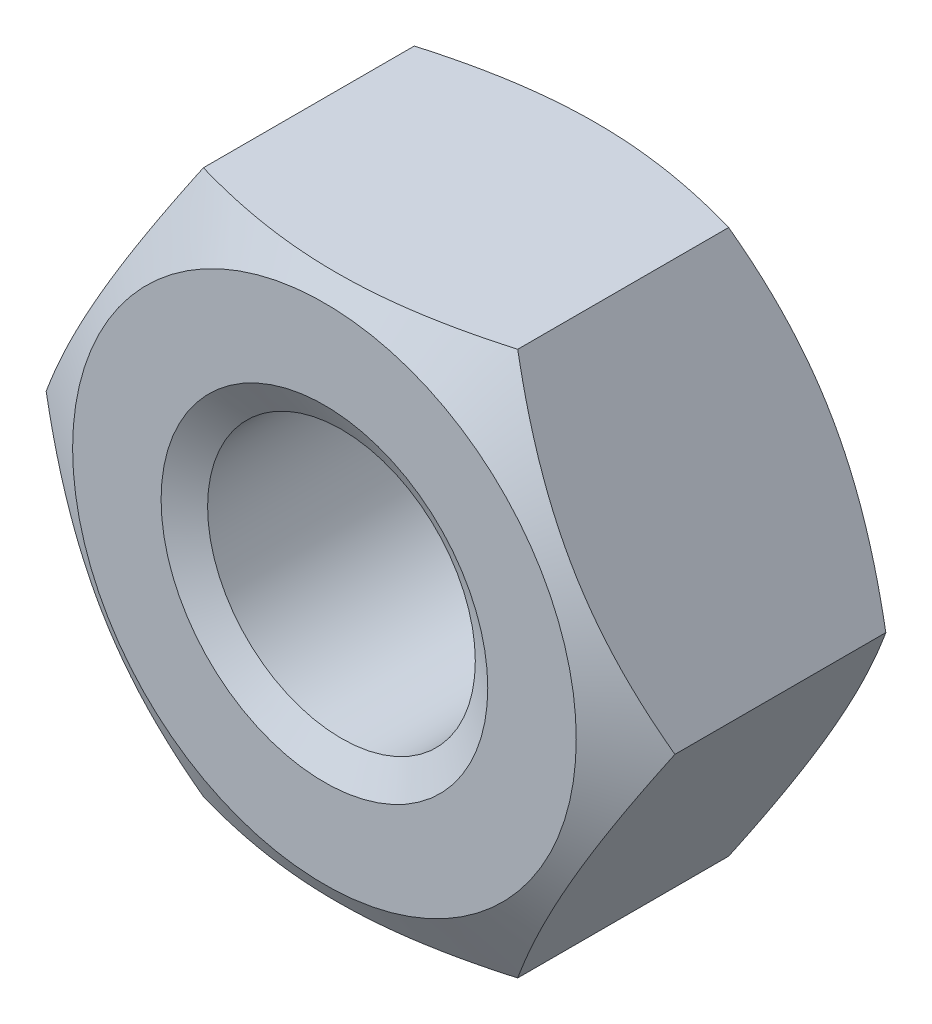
from build123d import *
from OCP.BRepFilletAPI import BRepFilletAPI_MakeChamfer

# Parameters (mm, degrees)
SKETCH1_R        = 2.4585
BASENUT_DEPTH    = 5.2
ENDCHAMFER_SIZE  = 0.5415
ENDCHAMFER_SIZE2 = 0.312635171


with BuildPart() as part:
    # Sketch1 → BaseNut (new body)
    with BuildSketch(Plane.XY):
        Polygon((5.773502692, 0), (2.886751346, 5), (-2.886751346, 5), (-5.773502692, 0), (-2.886751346, -5), (2.886751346, -5), align=None)
        Circle(SKETCH1_R, mode=Mode.SUBTRACT)
    extrude(amount=-BASENUT_DEPTH)

    # Sketch2 → Double-Chamfer (revolve, cut)
    with BuildSketch(Plane(origin=(0, 0, 0), x_dir=(1, 0, 0), z_dir=(0, 1, 0))):
        Polygon((-5.773502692, 5.2), (-4.625, 5.2), (-5.773502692, 4.536911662), align=None)
        Polygon((-5.773502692, 0.663088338), (-5.773502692, 0), (-4.625, 0), align=None)
    revolve(axis=Axis((0, 0, -3.375940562), (0, 0, 1)), mode=Mode.SUBTRACT)

    # EndChamfer: one chamfer whose edges measure the first distance from different faces: ONE call of the kernel's chamfer builder (chamfer() names one face for all edges)
    endchamfer_edges_1 = [part.edges().sort_by_distance(p)[0] for p in [
        (-2.4585, 0, -5.2),
    ]]
    endchamfer_side_1 = [part.faces().sort_by_distance(p)[0] for p in [
        (-2.4585, 0, -2.6),
    ]]
    endchamfer_edges_2 = [part.edges().sort_by_distance(p)[0] for p in [
        (-2.4585, 0, 0),
    ]]
    endchamfer_side_2 = [part.faces().sort_by_distance(p)[0] for p in [
        (4.494185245, 0, 0),
    ]]
    endchamfer = BRepFilletAPI_MakeChamfer(part.part.solid().wrapped)
    for e in endchamfer_edges_1:
        endchamfer.Add(ENDCHAMFER_SIZE, ENDCHAMFER_SIZE2, e.wrapped, endchamfer_side_1[0].wrapped)  # the first distance lies on this face
    for e in endchamfer_edges_2:
        endchamfer.Add(ENDCHAMFER_SIZE, ENDCHAMFER_SIZE2, e.wrapped, endchamfer_side_2[0].wrapped)  # the first distance lies on this face
    add(Compound.cast(endchamfer.Shape()), mode=Mode.REPLACE)


solid = part.part
